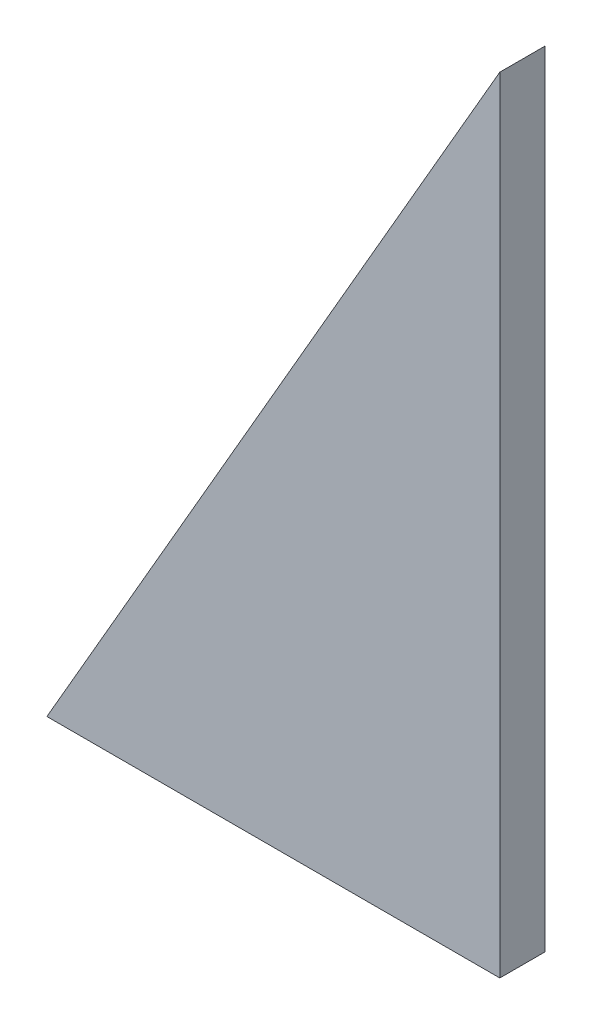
ISO-10303-21;
HEADER;
FILE_DESCRIPTION(('STEP AP214'),'2;1');
FILE_NAME('part.step','',(''),(''),'','','');
FILE_SCHEMA(('AUTOMOTIVE_DESIGN { 1 0 10303 214 1 1 1 1 }'));
ENDSEC;
DATA;
#1=APPLICATION_CONTEXT('core data for automotive mechanical design processes');
#2=APPLICATION_PROTOCOL_DEFINITION('international standard','automotive_design',2000,#1);
#3=PRODUCT_CONTEXT('',#1,'mechanical');
#4=PRODUCT('Part','Part','',(#3));
#5=PRODUCT_RELATED_PRODUCT_CATEGORY('part','',(#4));
#6=PRODUCT_DEFINITION_FORMATION('','',#4);
#7=PRODUCT_DEFINITION_CONTEXT('part definition',#1,'design');
#8=PRODUCT_DEFINITION('design','',#6,#7);
#9=PRODUCT_DEFINITION_SHAPE('','',#8);
#10=(LENGTH_UNIT() NAMED_UNIT(*) SI_UNIT(.MILLI.,.METRE.));
#11=(NAMED_UNIT(*) PLANE_ANGLE_UNIT() SI_UNIT($,.RADIAN.));
#12=(NAMED_UNIT(*) SI_UNIT($,.STERADIAN.) SOLID_ANGLE_UNIT());
#13=UNCERTAINTY_MEASURE_WITH_UNIT(LENGTH_MEASURE(1.E-05),#10,'distance_accuracy_value','');
#14=(GEOMETRIC_REPRESENTATION_CONTEXT(3) GLOBAL_UNCERTAINTY_ASSIGNED_CONTEXT((#13)) GLOBAL_UNIT_ASSIGNED_CONTEXT((#10,
#11,#12)) REPRESENTATION_CONTEXT('',''));
#15=CARTESIAN_POINT('',(0.,0.,0.));
#16=DIRECTION('',(0.,0.,1.));
#17=DIRECTION('',(1.,0.,0.));
#18=AXIS2_PLACEMENT_3D('',#15,#16,#17);
#19=CARTESIAN_POINT('',(80.,138.564064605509,8.));
#20=DIRECTION('',(0.866025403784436,-0.500000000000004,0.));
#21=DIRECTION('',(0.500000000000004,0.866025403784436,0.));
#22=AXIS2_PLACEMENT_3D('',#19,#20,#21);
#23=PLANE('',#22);
#24=CARTESIAN_POINT('',(17.5000000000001,30.3108891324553,4.));
#25=DIRECTION('',(-0.866025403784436,0.500000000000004,0.));
#26=DIRECTION('',(-0.500000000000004,-0.866025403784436,0.));
#27=AXIS2_PLACEMENT_3D('',#24,#25,#26);
#28=CIRCLE('',#27,2.1);
#29=CARTESIAN_POINT('',(16.4500000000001,28.492235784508,4.));
#30=VERTEX_POINT('',#29);
#31=EDGE_CURVE('E119',#30,#30,#28,.T.);
#32=ORIENTED_EDGE('',*,*,#31,.F.);
#33=EDGE_LOOP('',(#32));
#34=FACE_BOUND('',#33,.T.);
#35=CARTESIAN_POINT('',(55.0000000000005,95.262794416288,4.));
#36=DIRECTION('',(-0.866025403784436,0.500000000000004,0.));
#37=DIRECTION('',(-0.500000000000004,-0.866025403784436,0.));
#38=AXIS2_PLACEMENT_3D('',#35,#36,#37);
#39=CIRCLE('',#38,2.1);
#40=CARTESIAN_POINT('',(53.9500000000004,93.4441410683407,4.));
#41=VERTEX_POINT('',#40);
#42=EDGE_CURVE('E126',#41,#41,#39,.T.);
#43=ORIENTED_EDGE('',*,*,#42,.F.);
#44=EDGE_LOOP('',(#43));
#45=FACE_BOUND('',#44,.T.);
#46=DIRECTION('',(-0.500000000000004,-0.866025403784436,0.));
#47=VECTOR('',#46,1.);
#48=CARTESIAN_POINT('',(80.,138.564064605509,0.));
#49=LINE('',#48,#47);
#50=CARTESIAN_POINT('',(80.,138.564064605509,0.));
#51=VERTEX_POINT('',#50);
#52=CARTESIAN_POINT('',(0.,0.,0.));
#53=VERTEX_POINT('',#52);
#54=EDGE_CURVE('E134',#51,#53,#49,.T.);
#55=ORIENTED_EDGE('',*,*,#54,.T.);
#56=DIRECTION('',(0.,0.,-1.));
#57=VECTOR('',#56,1.);
#58=CARTESIAN_POINT('',(0.,0.,8.));
#59=LINE('',#58,#57);
#60=CARTESIAN_POINT('',(0.,0.,8.));
#61=VERTEX_POINT('',#60);
#62=EDGE_CURVE('E11',#61,#53,#59,.T.);
#63=ORIENTED_EDGE('',*,*,#62,.F.);
#64=DIRECTION('',(-0.500000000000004,-0.866025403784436,0.));
#65=VECTOR('',#64,1.);
#66=CARTESIAN_POINT('',(80.,138.564064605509,8.));
#67=LINE('',#66,#65);
#68=CARTESIAN_POINT('',(80.,138.564064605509,8.));
#69=VERTEX_POINT('',#68);
#70=EDGE_CURVE('E135',#69,#61,#67,.T.);
#71=ORIENTED_EDGE('',*,*,#70,.F.);
#72=DIRECTION('',(0.,0.,-1.));
#73=VECTOR('',#72,1.);
#74=CARTESIAN_POINT('',(80.,138.564064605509,8.));
#75=LINE('',#74,#73);
#76=EDGE_CURVE('E141',#69,#51,#75,.T.);
#77=ORIENTED_EDGE('',*,*,#76,.T.);
#78=EDGE_LOOP('',(#55,#63,#71,#77));
#79=FACE_BOUND('',#78,.T.);
#80=ADVANCED_FACE('F44',(#34,#45,#79),#23,.F.);
#81=CARTESIAN_POINT('',(0.,0.,8.));
#82=DIRECTION('',(0.,1.,0.));
#83=DIRECTION('',(0.,0.,1.));
#84=AXIS2_PLACEMENT_3D('',#81,#82,#83);
#85=PLANE('',#84);
#86=CARTESIAN_POINT('',(23.5,0.,4.));
#87=DIRECTION('',(0.,-1.,0.));
#88=DIRECTION('',(0.,0.,-1.));
#89=AXIS2_PLACEMENT_3D('',#86,#87,#88);
#90=CIRCLE('',#89,2.09999999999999);
#91=CARTESIAN_POINT('',(23.5,0.,1.90000000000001));
#92=VERTEX_POINT('',#91);
#93=EDGE_CURVE('E108',#92,#92,#90,.T.);
#94=ORIENTED_EDGE('',*,*,#93,.F.);
#95=EDGE_LOOP('',(#94));
#96=FACE_BOUND('',#95,.T.);
#97=CARTESIAN_POINT('',(53.5,0.,4.00000000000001));
#98=DIRECTION('',(0.,-1.,0.));
#99=DIRECTION('',(0.,0.,-1.));
#100=AXIS2_PLACEMENT_3D('',#97,#98,#99);
#101=CIRCLE('',#100,2.09999999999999);
#102=CARTESIAN_POINT('',(53.5,0.,1.90000000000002));
#103=VERTEX_POINT('',#102);
#104=EDGE_CURVE('E107',#103,#103,#101,.T.);
#105=ORIENTED_EDGE('',*,*,#104,.F.);
#106=EDGE_LOOP('',(#105));
#107=FACE_BOUND('',#106,.T.);
#108=DIRECTION('',(1.,0.,0.));
#109=VECTOR('',#108,1.);
#110=CARTESIAN_POINT('',(0.,0.,0.));
#111=LINE('',#110,#109);
#112=CARTESIAN_POINT('',(80.,0.,0.));
#113=VERTEX_POINT('',#112);
#114=EDGE_CURVE('E73',#53,#113,#111,.T.);
#115=ORIENTED_EDGE('',*,*,#114,.T.);
#116=DIRECTION('',(0.,0.,-1.));
#117=VECTOR('',#116,1.);
#118=CARTESIAN_POINT('',(80.,0.,8.));
#119=LINE('',#118,#117);
#120=CARTESIAN_POINT('',(80.,0.,8.));
#121=VERTEX_POINT('',#120);
#122=EDGE_CURVE('E52',#121,#113,#119,.T.);
#123=ORIENTED_EDGE('',*,*,#122,.F.);
#124=DIRECTION('',(1.,0.,0.));
#125=VECTOR('',#124,1.);
#126=CARTESIAN_POINT('',(0.,0.,8.));
#127=LINE('',#126,#125);
#128=EDGE_CURVE('E81',#61,#121,#127,.T.);
#129=ORIENTED_EDGE('',*,*,#128,.F.);
#130=ORIENTED_EDGE('',*,*,#62,.T.);
#131=EDGE_LOOP('',(#115,#123,#129,#130));
#132=FACE_BOUND('',#131,.T.);
#133=ADVANCED_FACE('F164',(#96,#107,#132),#85,.F.);
#134=CARTESIAN_POINT('',(80.,0.,8.));
#135=DIRECTION('',(-1.,0.,0.));
#136=DIRECTION('',(0.,0.,1.));
#137=AXIS2_PLACEMENT_3D('',#134,#135,#136);
#138=PLANE('',#137);
#139=DIRECTION('',(0.,1.,0.));
#140=VECTOR('',#139,1.);
#141=CARTESIAN_POINT('',(80.,0.,0.));
#142=LINE('',#141,#140);
#143=EDGE_CURVE('E78',#113,#51,#142,.T.);
#144=ORIENTED_EDGE('',*,*,#143,.T.);
#145=ORIENTED_EDGE('',*,*,#76,.F.);
#146=DIRECTION('',(0.,1.,0.));
#147=VECTOR('',#146,1.);
#148=CARTESIAN_POINT('',(80.,0.,8.));
#149=LINE('',#148,#147);
#150=EDGE_CURVE('E60',#121,#69,#149,.T.);
#151=ORIENTED_EDGE('',*,*,#150,.F.);
#152=ORIENTED_EDGE('',*,*,#122,.T.);
#153=EDGE_LOOP('',(#144,#145,#151,#152));
#154=FACE_BOUND('',#153,.T.);
#155=ADVANCED_FACE('F148',(#154),#138,.F.);
#156=CARTESIAN_POINT('',(0.,0.,8.));
#157=DIRECTION('',(0.,0.,1.));
#158=DIRECTION('',(1.,0.,0.));
#159=AXIS2_PLACEMENT_3D('',#156,#157,#158);
#160=PLANE('',#159);
#161=ORIENTED_EDGE('',*,*,#70,.T.);
#162=ORIENTED_EDGE('',*,*,#128,.T.);
#163=ORIENTED_EDGE('',*,*,#150,.T.);
#164=EDGE_LOOP('',(#161,#162,#163));
#165=FACE_BOUND('',#164,.T.);
#166=ADVANCED_FACE('F155',(#165),#160,.T.);
#167=CARTESIAN_POINT('',(0.,0.,0.));
#168=DIRECTION('',(0.,0.,1.));
#169=DIRECTION('',(1.,0.,0.));
#170=AXIS2_PLACEMENT_3D('',#167,#168,#169);
#171=PLANE('',#170);
#172=ORIENTED_EDGE('',*,*,#54,.F.);
#173=ORIENTED_EDGE('',*,*,#143,.F.);
#174=ORIENTED_EDGE('',*,*,#114,.F.);
#175=EDGE_LOOP('',(#172,#173,#174));
#176=FACE_BOUND('',#175,.T.);
#177=ADVANCED_FACE('F151',(#176),#171,.F.);
#178=CARTESIAN_POINT('',(67.1243556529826,88.2627944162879,4.));
#179=DIRECTION('',(-0.866025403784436,0.500000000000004,0.));
#180=DIRECTION('',(-0.500000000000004,-0.866025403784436,0.));
#181=AXIS2_PLACEMENT_3D('',#178,#179,#180);
#182=CONICAL_SURFACE('',#181,2.1,1.02974425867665);
#183=CARTESIAN_POINT('',(68.2171128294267,87.631890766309,4.));
#184=VERTEX_POINT('',#183);
#185=VERTEX_LOOP('',#184);
#186=FACE_BOUND('',#185,.T.);
#187=CARTESIAN_POINT('',(67.1243556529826,88.2627944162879,4.));
#188=DIRECTION('',(-0.866025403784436,0.500000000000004,0.));
#189=DIRECTION('',(-0.500000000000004,-0.866025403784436,0.));
#190=AXIS2_PLACEMENT_3D('',#187,#188,#189);
#191=CIRCLE('',#190,2.1);
#192=CARTESIAN_POINT('',(66.0743556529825,86.4441410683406,4.));
#193=VERTEX_POINT('',#192);
#194=EDGE_CURVE('E130',#193,#193,#191,.T.);
#195=ORIENTED_EDGE('',*,*,#194,.T.);
#196=EDGE_LOOP('',(#195));
#197=FACE_BOUND('',#196,.T.);
#198=ADVANCED_FACE('F162',(#186,#197),#182,.F.);
#199=CARTESIAN_POINT('',(55.0000000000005,95.262794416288,4.));
#200=DIRECTION('',(-0.866025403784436,0.500000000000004,0.));
#201=DIRECTION('',(-0.500000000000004,-0.866025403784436,0.));
#202=AXIS2_PLACEMENT_3D('',#199,#200,#201);
#203=CYLINDRICAL_SURFACE('',#202,2.1);
#204=ORIENTED_EDGE('',*,*,#194,.F.);
#205=EDGE_LOOP('',(#204));
#206=FACE_BOUND('',#205,.T.);
#207=ORIENTED_EDGE('',*,*,#42,.T.);
#208=EDGE_LOOP('',(#207));
#209=FACE_BOUND('',#208,.T.);
#210=ADVANCED_FACE('F177',(#206,#209),#203,.F.);
#211=CARTESIAN_POINT('',(29.6243556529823,23.3108891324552,4.));
#212=DIRECTION('',(-0.866025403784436,0.500000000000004,0.));
#213=DIRECTION('',(-0.500000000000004,-0.866025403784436,0.));
#214=AXIS2_PLACEMENT_3D('',#211,#212,#213);
#215=CONICAL_SURFACE('',#214,2.1,1.02974425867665);
#216=CARTESIAN_POINT('',(30.7171128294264,22.6799854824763,4.));
#217=VERTEX_POINT('',#216);
#218=VERTEX_LOOP('',#217);
#219=FACE_BOUND('',#218,.T.);
#220=CARTESIAN_POINT('',(29.6243556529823,23.3108891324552,4.));
#221=DIRECTION('',(-0.866025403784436,0.500000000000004,0.));
#222=DIRECTION('',(-0.500000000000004,-0.866025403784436,0.));
#223=AXIS2_PLACEMENT_3D('',#220,#221,#222);
#224=CIRCLE('',#223,2.1);
#225=CARTESIAN_POINT('',(28.5743556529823,21.4922357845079,4.));
#226=VERTEX_POINT('',#225);
#227=EDGE_CURVE('E123',#226,#226,#224,.T.);
#228=ORIENTED_EDGE('',*,*,#227,.T.);
#229=EDGE_LOOP('',(#228));
#230=FACE_BOUND('',#229,.T.);
#231=ADVANCED_FACE('F179',(#219,#230),#215,.F.);
#232=CARTESIAN_POINT('',(17.5000000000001,30.3108891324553,4.));
#233=DIRECTION('',(-0.866025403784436,0.500000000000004,0.));
#234=DIRECTION('',(-0.500000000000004,-0.866025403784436,0.));
#235=AXIS2_PLACEMENT_3D('',#232,#233,#234);
#236=CYLINDRICAL_SURFACE('',#235,2.1);
#237=ORIENTED_EDGE('',*,*,#227,.F.);
#238=EDGE_LOOP('',(#237));
#239=FACE_BOUND('',#238,.T.);
#240=ORIENTED_EDGE('',*,*,#31,.T.);
#241=EDGE_LOOP('',(#240));
#242=FACE_BOUND('',#241,.T.);
#243=ADVANCED_FACE('F186',(#239,#242),#236,.F.);
#244=CARTESIAN_POINT('',(53.5,14.,4.00000000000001));
#245=DIRECTION('',(0.,-1.,0.));
#246=DIRECTION('',(0.,0.,-1.));
#247=AXIS2_PLACEMENT_3D('',#244,#245,#246);
#248=CONICAL_SURFACE('',#247,2.09999999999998,1.02974425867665);
#249=CARTESIAN_POINT('',(53.5,15.2618072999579,4.00000000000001));
#250=VERTEX_POINT('',#249);
#251=VERTEX_LOOP('',#250);
#252=FACE_BOUND('',#251,.T.);
#253=CARTESIAN_POINT('',(53.5,14.,4.00000000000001));
#254=DIRECTION('',(0.,-1.,0.));
#255=DIRECTION('',(0.,0.,-1.));
#256=AXIS2_PLACEMENT_3D('',#253,#254,#255);
#257=CIRCLE('',#256,2.09999999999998);
#258=CARTESIAN_POINT('',(53.5,14.,1.90000000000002));
#259=VERTEX_POINT('',#258);
#260=EDGE_CURVE('E112',#259,#259,#257,.T.);
#261=ORIENTED_EDGE('',*,*,#260,.T.);
#262=EDGE_LOOP('',(#261));
#263=FACE_BOUND('',#262,.T.);
#264=ADVANCED_FACE('F194',(#252,#263),#248,.F.);
#265=CARTESIAN_POINT('',(53.5,0.,4.00000000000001));
#266=DIRECTION('',(0.,-1.,0.));
#267=DIRECTION('',(0.,0.,-1.));
#268=AXIS2_PLACEMENT_3D('',#265,#266,#267);
#269=CYLINDRICAL_SURFACE('',#268,2.09999999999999);
#270=ORIENTED_EDGE('',*,*,#260,.F.);
#271=EDGE_LOOP('',(#270));
#272=FACE_BOUND('',#271,.T.);
#273=ORIENTED_EDGE('',*,*,#104,.T.);
#274=EDGE_LOOP('',(#273));
#275=FACE_BOUND('',#274,.T.);
#276=ADVANCED_FACE('F100',(#272,#275),#269,.F.);
#277=CARTESIAN_POINT('',(23.5,14.,4.));
#278=DIRECTION('',(0.,-1.,0.));
#279=DIRECTION('',(0.,0.,-1.));
#280=AXIS2_PLACEMENT_3D('',#277,#278,#279);
#281=CONICAL_SURFACE('',#280,2.09999999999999,1.02974425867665);
#282=CARTESIAN_POINT('',(23.5,15.2618072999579,4.));
#283=VERTEX_POINT('',#282);
#284=VERTEX_LOOP('',#283);
#285=FACE_BOUND('',#284,.T.);
#286=CARTESIAN_POINT('',(23.5,14.,4.));
#287=DIRECTION('',(0.,-1.,0.));
#288=DIRECTION('',(0.,0.,-1.));
#289=AXIS2_PLACEMENT_3D('',#286,#287,#288);
#290=CIRCLE('',#289,2.09999999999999);
#291=CARTESIAN_POINT('',(23.5,14.,1.90000000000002));
#292=VERTEX_POINT('',#291);
#293=EDGE_CURVE('E104',#292,#292,#290,.T.);
#294=ORIENTED_EDGE('',*,*,#293,.T.);
#295=EDGE_LOOP('',(#294));
#296=FACE_BOUND('',#295,.T.);
#297=ADVANCED_FACE('F96',(#285,#296),#281,.F.);
#298=CARTESIAN_POINT('',(23.5,0.,4.));
#299=DIRECTION('',(0.,-1.,0.));
#300=DIRECTION('',(0.,0.,-1.));
#301=AXIS2_PLACEMENT_3D('',#298,#299,#300);
#302=CYLINDRICAL_SURFACE('',#301,2.09999999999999);
#303=ORIENTED_EDGE('',*,*,#293,.F.);
#304=EDGE_LOOP('',(#303));
#305=FACE_BOUND('',#304,.T.);
#306=ORIENTED_EDGE('',*,*,#93,.T.);
#307=EDGE_LOOP('',(#306));
#308=FACE_BOUND('',#307,.T.);
#309=ADVANCED_FACE('F99',(#305,#308),#302,.F.);
#310=CLOSED_SHELL('',(#80,#133,#155,#166,#177,#198,#210,#231,#243,#264,#276,#297,#309));
#311=MANIFOLD_SOLID_BREP('B2',#310);
#312=ADVANCED_BREP_SHAPE_REPRESENTATION('',(#18,#311),#14);
#313=SHAPE_DEFINITION_REPRESENTATION(#9,#312);
ENDSEC;
END-ISO-10303-21;
